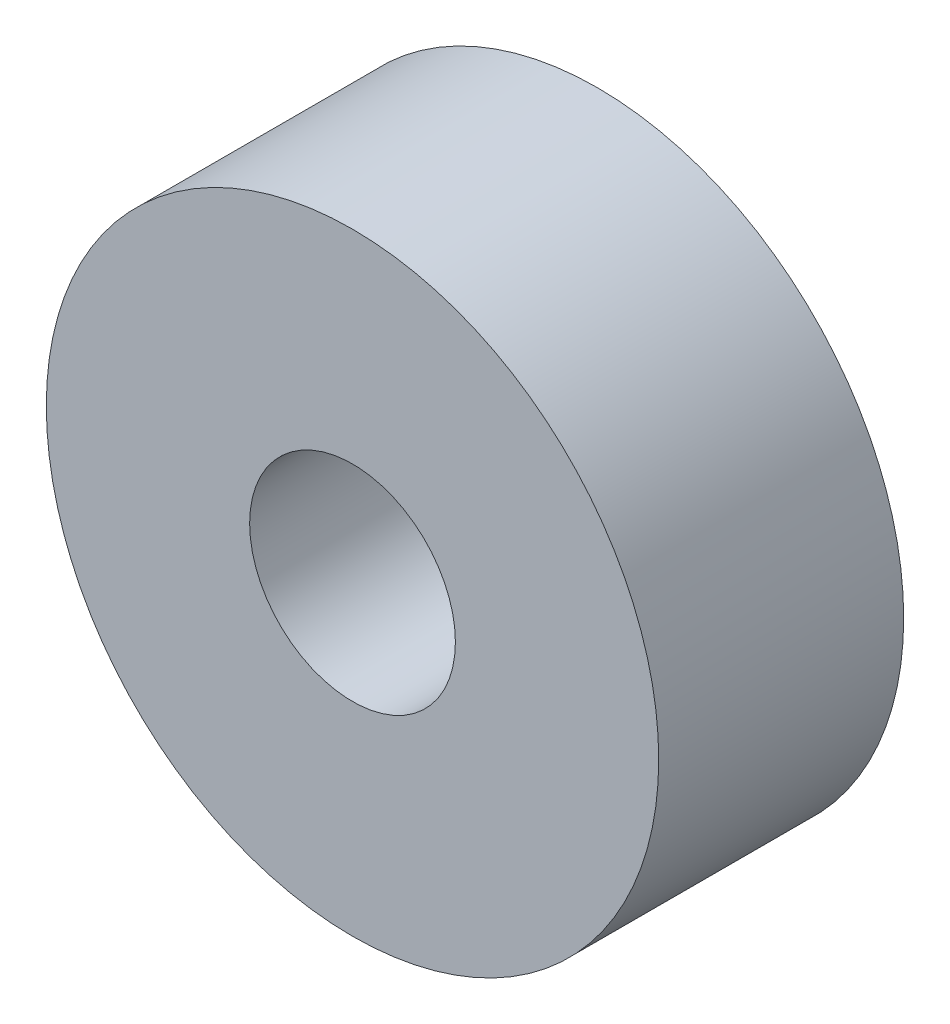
ISO-10303-21;
HEADER;
FILE_DESCRIPTION(('STEP AP214'),'2;1');
FILE_NAME('part.step','',(''),(''),'','','');
FILE_SCHEMA(('AUTOMOTIVE_DESIGN { 1 0 10303 214 1 1 1 1 }'));
ENDSEC;
DATA;
#1=APPLICATION_CONTEXT('core data for automotive mechanical design processes');
#2=APPLICATION_PROTOCOL_DEFINITION('international standard','automotive_design',2000,#1);
#3=PRODUCT_CONTEXT('',#1,'mechanical');
#4=PRODUCT('Part','Part','',(#3));
#5=PRODUCT_RELATED_PRODUCT_CATEGORY('part','',(#4));
#6=PRODUCT_DEFINITION_FORMATION('','',#4);
#7=PRODUCT_DEFINITION_CONTEXT('part definition',#1,'design');
#8=PRODUCT_DEFINITION('design','',#6,#7);
#9=PRODUCT_DEFINITION_SHAPE('','',#8);
#10=(LENGTH_UNIT() NAMED_UNIT(*) SI_UNIT(.MILLI.,.METRE.));
#11=(NAMED_UNIT(*) PLANE_ANGLE_UNIT() SI_UNIT($,.RADIAN.));
#12=(NAMED_UNIT(*) SI_UNIT($,.STERADIAN.) SOLID_ANGLE_UNIT());
#13=UNCERTAINTY_MEASURE_WITH_UNIT(LENGTH_MEASURE(1.E-05),#10,'distance_accuracy_value','');
#14=(GEOMETRIC_REPRESENTATION_CONTEXT(3) GLOBAL_UNCERTAINTY_ASSIGNED_CONTEXT((#13)) GLOBAL_UNIT_ASSIGNED_CONTEXT((#10,
#11,#12)) REPRESENTATION_CONTEXT('',''));
#15=CARTESIAN_POINT('',(0.,0.,0.));
#16=DIRECTION('',(0.,0.,1.));
#17=DIRECTION('',(1.,0.,0.));
#18=AXIS2_PLACEMENT_3D('',#15,#16,#17);
#19=CARTESIAN_POINT('',(0.,0.,10.));
#20=DIRECTION('',(0.,0.,1.));
#21=DIRECTION('',(1.,0.,0.));
#22=AXIS2_PLACEMENT_3D('',#19,#20,#21);
#23=PLANE('',#22);
#24=CARTESIAN_POINT('',(0.,0.,10.));
#25=DIRECTION('',(0.,0.,1.));
#26=DIRECTION('',(1.,0.,0.));
#27=AXIS2_PLACEMENT_3D('',#24,#25,#26);
#28=CIRCLE('',#27,12.5);
#29=CARTESIAN_POINT('',(12.5,0.,10.));
#30=VERTEX_POINT('',#29);
#31=EDGE_CURVE('E8',#30,#30,#28,.T.);
#32=ORIENTED_EDGE('',*,*,#31,.T.);
#33=EDGE_LOOP('',(#32));
#34=FACE_BOUND('',#33,.T.);
#35=CARTESIAN_POINT('',(0.,0.,10.));
#36=DIRECTION('',(0.,0.,1.));
#37=DIRECTION('',(1.,0.,0.));
#38=AXIS2_PLACEMENT_3D('',#35,#36,#37);
#39=CIRCLE('',#38,4.2);
#40=CARTESIAN_POINT('',(4.2,0.,10.));
#41=VERTEX_POINT('',#40);
#42=EDGE_CURVE('E23',#41,#41,#39,.T.);
#43=ORIENTED_EDGE('',*,*,#42,.F.);
#44=EDGE_LOOP('',(#43));
#45=FACE_BOUND('',#44,.T.);
#46=ADVANCED_FACE('F12',(#34,#45),#23,.T.);
#47=CARTESIAN_POINT('',(0.,0.,0.));
#48=DIRECTION('',(0.,0.,1.));
#49=DIRECTION('',(1.,0.,0.));
#50=AXIS2_PLACEMENT_3D('',#47,#48,#49);
#51=PLANE('',#50);
#52=CARTESIAN_POINT('',(0.,0.,0.));
#53=DIRECTION('',(0.,0.,1.));
#54=DIRECTION('',(1.,0.,0.));
#55=AXIS2_PLACEMENT_3D('',#52,#53,#54);
#56=CIRCLE('',#55,12.5);
#57=CARTESIAN_POINT('',(12.5,0.,0.));
#58=VERTEX_POINT('',#57);
#59=EDGE_CURVE('E19',#58,#58,#56,.T.);
#60=ORIENTED_EDGE('',*,*,#59,.F.);
#61=EDGE_LOOP('',(#60));
#62=FACE_BOUND('',#61,.T.);
#63=CARTESIAN_POINT('',(0.,0.,0.));
#64=DIRECTION('',(0.,0.,1.));
#65=DIRECTION('',(1.,0.,0.));
#66=AXIS2_PLACEMENT_3D('',#63,#64,#65);
#67=CIRCLE('',#66,4.2);
#68=CARTESIAN_POINT('',(4.2,0.,0.));
#69=VERTEX_POINT('',#68);
#70=EDGE_CURVE('E27',#69,#69,#67,.T.);
#71=ORIENTED_EDGE('',*,*,#70,.T.);
#72=EDGE_LOOP('',(#71));
#73=FACE_BOUND('',#72,.T.);
#74=ADVANCED_FACE('F33',(#62,#73),#51,.F.);
#75=CARTESIAN_POINT('',(0.,0.,10.));
#76=DIRECTION('',(0.,0.,-1.));
#77=DIRECTION('',(-1.,0.,0.));
#78=AXIS2_PLACEMENT_3D('',#75,#76,#77);
#79=CYLINDRICAL_SURFACE('',#78,12.5);
#80=ORIENTED_EDGE('',*,*,#31,.F.);
#81=EDGE_LOOP('',(#80));
#82=FACE_BOUND('',#81,.T.);
#83=ORIENTED_EDGE('',*,*,#59,.T.);
#84=EDGE_LOOP('',(#83));
#85=FACE_BOUND('',#84,.T.);
#86=ADVANCED_FACE('F14',(#82,#85),#79,.T.);
#87=CARTESIAN_POINT('',(0.,0.,10.));
#88=DIRECTION('',(0.,0.,-1.));
#89=DIRECTION('',(-1.,0.,0.));
#90=AXIS2_PLACEMENT_3D('',#87,#88,#89);
#91=CYLINDRICAL_SURFACE('',#90,4.2);
#92=ORIENTED_EDGE('',*,*,#42,.T.);
#93=EDGE_LOOP('',(#92));
#94=FACE_BOUND('',#93,.T.);
#95=ORIENTED_EDGE('',*,*,#70,.F.);
#96=EDGE_LOOP('',(#95));
#97=FACE_BOUND('',#96,.T.);
#98=ADVANCED_FACE('F35',(#94,#97),#91,.F.);
#99=CLOSED_SHELL('',(#46,#74,#86,#98));
#100=MANIFOLD_SOLID_BREP('B1',#99);
#101=ADVANCED_BREP_SHAPE_REPRESENTATION('',(#18,#100),#14);
#102=SHAPE_DEFINITION_REPRESENTATION(#9,#101);
ENDSEC;
END-ISO-10303-21;
